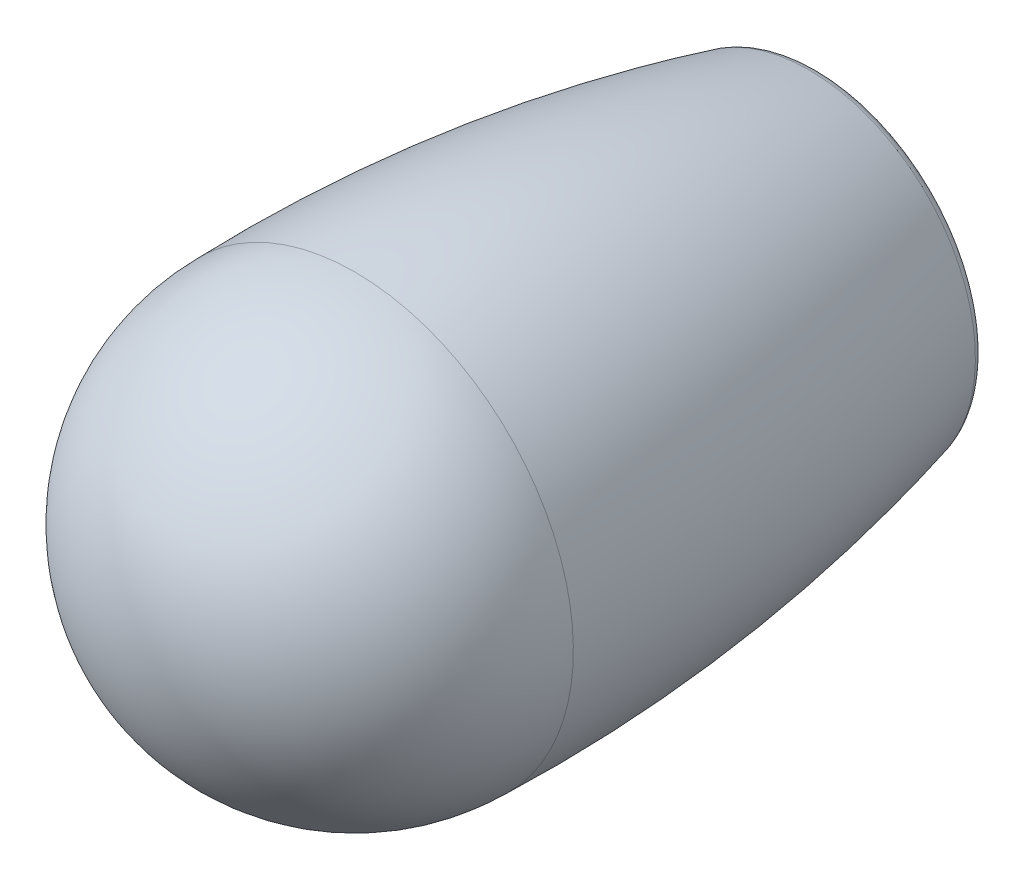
ISO-10303-21;
HEADER;
FILE_DESCRIPTION(('STEP AP214'),'2;1');
FILE_NAME('part.step','',(''),(''),'','','');
FILE_SCHEMA(('AUTOMOTIVE_DESIGN { 1 0 10303 214 1 1 1 1 }'));
ENDSEC;
DATA;
#1=APPLICATION_CONTEXT('core data for automotive mechanical design processes');
#2=APPLICATION_PROTOCOL_DEFINITION('international standard','automotive_design',2000,#1);
#3=PRODUCT_CONTEXT('',#1,'mechanical');
#4=PRODUCT('Part','Part','',(#3));
#5=PRODUCT_RELATED_PRODUCT_CATEGORY('part','',(#4));
#6=PRODUCT_DEFINITION_FORMATION('','',#4);
#7=PRODUCT_DEFINITION_CONTEXT('part definition',#1,'design');
#8=PRODUCT_DEFINITION('design','',#6,#7);
#9=PRODUCT_DEFINITION_SHAPE('','',#8);
#10=(LENGTH_UNIT() NAMED_UNIT(*) SI_UNIT(.MILLI.,.METRE.));
#11=(NAMED_UNIT(*) PLANE_ANGLE_UNIT() SI_UNIT($,.RADIAN.));
#12=(NAMED_UNIT(*) SI_UNIT($,.STERADIAN.) SOLID_ANGLE_UNIT());
#13=UNCERTAINTY_MEASURE_WITH_UNIT(LENGTH_MEASURE(1.E-05),#10,'distance_accuracy_value','');
#14=(GEOMETRIC_REPRESENTATION_CONTEXT(3) GLOBAL_UNCERTAINTY_ASSIGNED_CONTEXT((#13)) GLOBAL_UNIT_ASSIGNED_CONTEXT((#10,
#11,#12)) REPRESENTATION_CONTEXT('',''));
#15=CARTESIAN_POINT('',(0.,0.,0.));
#16=DIRECTION('',(0.,0.,1.));
#17=DIRECTION('',(1.,0.,0.));
#18=AXIS2_PLACEMENT_3D('',#15,#16,#17);
#19=CARTESIAN_POINT('',(0.,0.,16.999768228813));
#20=DIRECTION('',(0.,0.,1.));
#21=DIRECTION('',(0.,1.,0.));
#22=AXIS2_PLACEMENT_3D('',#19,#20,#21);
#23=SPHERICAL_SURFACE('',#22,8.);
#24=CARTESIAN_POINT('',(0.,0.,16.999768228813));
#25=DIRECTION('',(0.,0.,1.));
#26=DIRECTION('',(0.,1.,0.));
#27=AXIS2_PLACEMENT_3D('',#24,#25,#26);
#28=CIRCLE('',#27,8.);
#29=CARTESIAN_POINT('',(0.,7.99999999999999,16.999768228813));
#30=VERTEX_POINT('',#29);
#31=EDGE_CURVE('E8',#30,#30,#28,.T.);
#32=ORIENTED_EDGE('',*,*,#31,.T.);
#33=EDGE_LOOP('',(#32));
#34=FACE_BOUND('',#33,.T.);
#35=ADVANCED_FACE('F12',(#34),#23,.T.);
#36=CARTESIAN_POINT('',(0.,0.,15.447943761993));
#37=DIRECTION('',(0.,0.,1.));
#38=DIRECTION('',(0.,1.,0.));
#39=AXIS2_PLACEMENT_3D('',#36,#37,#38);
#40=DEGENERATE_TOROIDAL_SURFACE('',#39,51.979928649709,60.,.F.);
#41=CARTESIAN_POINT('',(0.,0.,0.37438702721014));
#42=DIRECTION('',(0.,0.,1.));
#43=DIRECTION('',(0.,1.,0.));
#44=AXIS2_PLACEMENT_3D('',#41,#42,#43);
#45=CIRCLE('',#44,6.09577958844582);
#46=CARTESIAN_POINT('',(0.,6.09577958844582,0.374387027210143));
#47=VERTEX_POINT('',#46);
#48=EDGE_CURVE('E18',#47,#47,#45,.T.);
#49=ORIENTED_EDGE('',*,*,#48,.T.);
#50=EDGE_LOOP('',(#49));
#51=FACE_BOUND('',#50,.T.);
#52=ORIENTED_EDGE('',*,*,#31,.F.);
#53=EDGE_LOOP('',(#52));
#54=FACE_BOUND('',#53,.T.);
#55=ADVANCED_FACE('F55',(#51,#54),#40,.F.);
#56=CARTESIAN_POINT('',(0.,0.,0.5));
#57=DIRECTION('',(0.,0.,1.));
#58=DIRECTION('',(0.,1.,0.));
#59=AXIS2_PLACEMENT_3D('',#56,#57,#58);
#60=TOROIDAL_SURFACE('',#59,5.61181535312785,0.50000000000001);
#61=CARTESIAN_POINT('',(0.,0.,0.));
#62=DIRECTION('',(0.,0.,1.));
#63=DIRECTION('',(0.,1.,0.));
#64=AXIS2_PLACEMENT_3D('',#61,#62,#63);
#65=CIRCLE('',#64,5.61181535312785);
#66=CARTESIAN_POINT('',(0.,5.61181535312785,0.));
#67=VERTEX_POINT('',#66);
#68=EDGE_CURVE('E22',#67,#67,#65,.T.);
#69=ORIENTED_EDGE('',*,*,#68,.T.);
#70=EDGE_LOOP('',(#69));
#71=FACE_BOUND('',#70,.T.);
#72=ORIENTED_EDGE('',*,*,#48,.F.);
#73=EDGE_LOOP('',(#72));
#74=FACE_BOUND('',#73,.T.);
#75=ADVANCED_FACE('F60',(#71,#74),#60,.T.);
#76=CARTESIAN_POINT('',(0.,3.25,0.));
#77=DIRECTION('',(0.,0.,-1.));
#78=DIRECTION('',(0.,-1.,0.));
#79=AXIS2_PLACEMENT_3D('',#76,#77,#78);
#80=PLANE('',#79);
#81=CARTESIAN_POINT('',(0.,0.,0.));
#82=DIRECTION('',(0.,0.,1.));
#83=DIRECTION('',(0.,1.,0.));
#84=AXIS2_PLACEMENT_3D('',#81,#82,#83);
#85=CIRCLE('',#84,3.25);
#86=CARTESIAN_POINT('',(0.,3.25,0.));
#87=VERTEX_POINT('',#86);
#88=EDGE_CURVE('E26',#87,#87,#85,.T.);
#89=ORIENTED_EDGE('',*,*,#88,.T.);
#90=EDGE_LOOP('',(#89));
#91=FACE_BOUND('',#90,.T.);
#92=ORIENTED_EDGE('',*,*,#68,.F.);
#93=EDGE_LOOP('',(#92));
#94=FACE_BOUND('',#93,.T.);
#95=ADVANCED_FACE('F65',(#91,#94),#80,.T.);
#96=CARTESIAN_POINT('',(0.,0.,27.500040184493));
#97=DIRECTION('',(0.,0.,1.));
#98=DIRECTION('',(0.,1.,0.));
#99=AXIS2_PLACEMENT_3D('',#96,#97,#98);
#100=CYLINDRICAL_SURFACE('',#99,3.25);
#101=CARTESIAN_POINT('',(0.,0.,3.5));
#102=DIRECTION('',(0.,0.,1.));
#103=DIRECTION('',(0.,1.,0.));
#104=AXIS2_PLACEMENT_3D('',#101,#102,#103);
#105=CIRCLE('',#104,3.25);
#106=CARTESIAN_POINT('',(0.,3.25,3.5));
#107=VERTEX_POINT('',#106);
#108=EDGE_CURVE('E31',#107,#107,#105,.T.);
#109=ORIENTED_EDGE('',*,*,#108,.T.);
#110=EDGE_LOOP('',(#109));
#111=FACE_BOUND('',#110,.T.);
#112=ORIENTED_EDGE('',*,*,#88,.F.);
#113=EDGE_LOOP('',(#112));
#114=FACE_BOUND('',#113,.T.);
#115=ADVANCED_FACE('F72',(#111,#114),#100,.F.);
#116=CARTESIAN_POINT('',(0.,3.25,3.5));
#117=DIRECTION('',(0.,0.,-1.));
#118=DIRECTION('',(0.,-1.,0.));
#119=AXIS2_PLACEMENT_3D('',#116,#117,#118);
#120=PLANE('',#119);
#121=CARTESIAN_POINT('',(0.,0.,3.5));
#122=DIRECTION('',(0.,0.,1.));
#123=DIRECTION('',(0.,1.,0.));
#124=AXIS2_PLACEMENT_3D('',#121,#122,#123);
#125=CIRCLE('',#124,3.);
#126=CARTESIAN_POINT('',(0.,3.,3.5));
#127=VERTEX_POINT('',#126);
#128=EDGE_CURVE('E34',#127,#127,#125,.T.);
#129=ORIENTED_EDGE('',*,*,#128,.T.);
#130=EDGE_LOOP('',(#129));
#131=FACE_BOUND('',#130,.T.);
#132=ORIENTED_EDGE('',*,*,#108,.F.);
#133=EDGE_LOOP('',(#132));
#134=FACE_BOUND('',#133,.T.);
#135=ADVANCED_FACE('F52',(#131,#134),#120,.T.);
#136=CARTESIAN_POINT('',(0.,0.,27.500040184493));
#137=DIRECTION('',(0.,0.,1.));
#138=DIRECTION('',(0.,1.,0.));
#139=AXIS2_PLACEMENT_3D('',#136,#137,#138);
#140=CYLINDRICAL_SURFACE('',#139,3.);
#141=CARTESIAN_POINT('',(0.,0.,16.));
#142=DIRECTION('',(0.,0.,1.));
#143=DIRECTION('',(0.,1.,0.));
#144=AXIS2_PLACEMENT_3D('',#141,#142,#143);
#145=CIRCLE('',#144,3.);
#146=CARTESIAN_POINT('',(0.,2.99999999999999,16.));
#147=VERTEX_POINT('',#146);
#148=EDGE_CURVE('E37',#147,#147,#145,.T.);
#149=ORIENTED_EDGE('',*,*,#148,.T.);
#150=EDGE_LOOP('',(#149));
#151=FACE_BOUND('',#150,.T.);
#152=ORIENTED_EDGE('',*,*,#128,.F.);
#153=EDGE_LOOP('',(#152));
#154=FACE_BOUND('',#153,.T.);
#155=ADVANCED_FACE('F41',(#151,#154),#140,.F.);
#156=CARTESIAN_POINT('',(0.,0.,16.));
#157=DIRECTION('',(0.,0.,-1.));
#158=DIRECTION('',(0.,-1.,0.));
#159=AXIS2_PLACEMENT_3D('',#156,#157,#158);
#160=PLANE('',#159);
#161=ORIENTED_EDGE('',*,*,#148,.F.);
#162=EDGE_LOOP('',(#161));
#163=FACE_BOUND('',#162,.T.);
#164=ADVANCED_FACE('F44',(#163),#160,.T.);
#165=CLOSED_SHELL('',(#35,#55,#75,#95,#115,#135,#155,#164));
#166=MANIFOLD_SOLID_BREP('B1',#165);
#167=ADVANCED_BREP_SHAPE_REPRESENTATION('',(#18,#166),#14);
#168=SHAPE_DEFINITION_REPRESENTATION(#9,#167);
ENDSEC;
END-ISO-10303-21;
